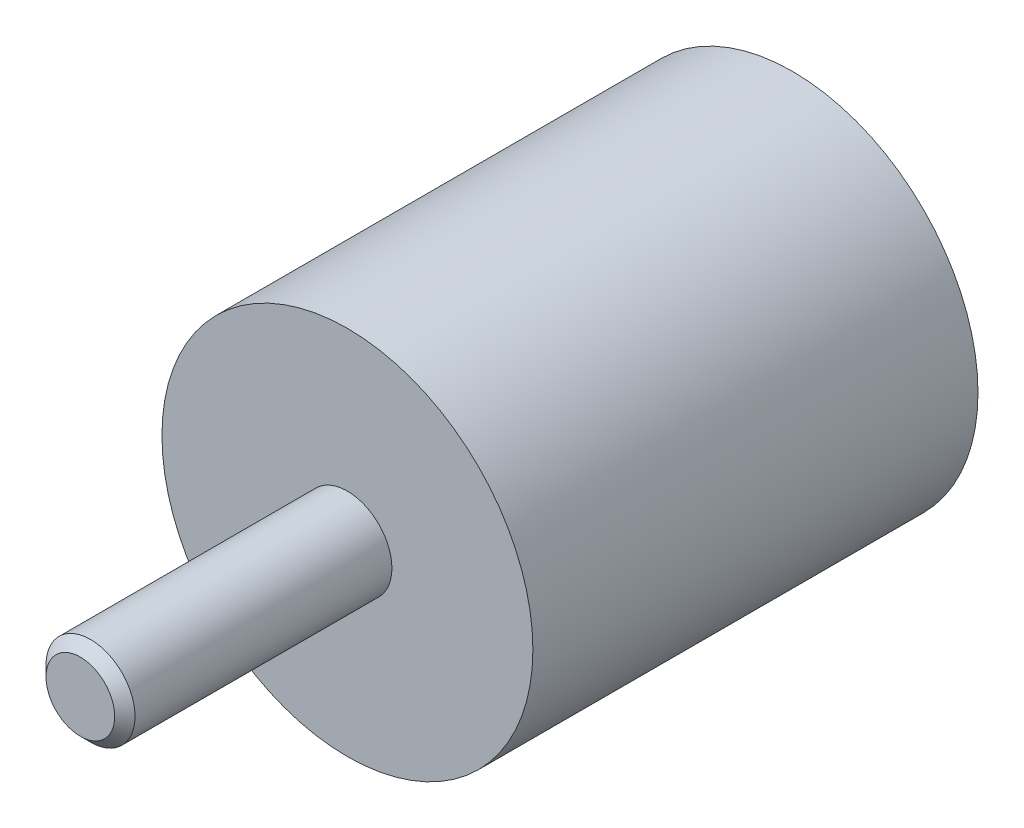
ISO-10303-21;
HEADER;
FILE_DESCRIPTION(('STEP AP214'),'2;1');
FILE_NAME('part.step','',(''),(''),'','','');
FILE_SCHEMA(('AUTOMOTIVE_DESIGN { 1 0 10303 214 1 1 1 1 }'));
ENDSEC;
DATA;
#1=APPLICATION_CONTEXT('core data for automotive mechanical design processes');
#2=APPLICATION_PROTOCOL_DEFINITION('international standard','automotive_design',2000,#1);
#3=PRODUCT_CONTEXT('',#1,'mechanical');
#4=PRODUCT('Part','Part','',(#3));
#5=PRODUCT_RELATED_PRODUCT_CATEGORY('part','',(#4));
#6=PRODUCT_DEFINITION_FORMATION('','',#4);
#7=PRODUCT_DEFINITION_CONTEXT('part definition',#1,'design');
#8=PRODUCT_DEFINITION('design','',#6,#7);
#9=PRODUCT_DEFINITION_SHAPE('','',#8);
#10=(LENGTH_UNIT() NAMED_UNIT(*) SI_UNIT(.MILLI.,.METRE.));
#11=(NAMED_UNIT(*) PLANE_ANGLE_UNIT() SI_UNIT($,.RADIAN.));
#12=(NAMED_UNIT(*) SI_UNIT($,.STERADIAN.) SOLID_ANGLE_UNIT());
#13=UNCERTAINTY_MEASURE_WITH_UNIT(LENGTH_MEASURE(1.E-05),#10,'distance_accuracy_value','');
#14=(GEOMETRIC_REPRESENTATION_CONTEXT(3) GLOBAL_UNCERTAINTY_ASSIGNED_CONTEXT((#13)) GLOBAL_UNIT_ASSIGNED_CONTEXT((#10,
#11,#12)) REPRESENTATION_CONTEXT('',''));
#15=CARTESIAN_POINT('',(0.,0.,0.));
#16=DIRECTION('',(0.,0.,1.));
#17=DIRECTION('',(1.,0.,0.));
#18=AXIS2_PLACEMENT_3D('',#15,#16,#17);
#19=CARTESIAN_POINT('',(0.,0.,0.5));
#20=DIRECTION('',(0.,0.,1.));
#21=DIRECTION('',(0.,-1.,0.));
#22=AXIS2_PLACEMENT_3D('',#19,#20,#21);
#23=CYLINDRICAL_SURFACE('',#22,12.5);
#24=CARTESIAN_POINT('',(0.,0.,0.));
#25=DIRECTION('',(0.,0.,1.));
#26=DIRECTION('',(0.,-1.,0.));
#27=AXIS2_PLACEMENT_3D('',#24,#25,#26);
#28=CIRCLE('',#27,12.5);
#29=CARTESIAN_POINT('',(0.,-12.5,0.));
#30=VERTEX_POINT('',#29);
#31=EDGE_CURVE('E27',#30,#30,#28,.T.);
#32=ORIENTED_EDGE('',*,*,#31,.T.);
#33=EDGE_LOOP('',(#32));
#34=FACE_BOUND('',#33,.T.);
#35=CARTESIAN_POINT('',(0.,0.,30.));
#36=DIRECTION('',(0.,0.,-1.));
#37=DIRECTION('',(-1.,0.,0.));
#38=AXIS2_PLACEMENT_3D('',#35,#36,#37);
#39=CIRCLE('',#38,12.5);
#40=CARTESIAN_POINT('',(-12.5,0.,30.));
#41=VERTEX_POINT('',#40);
#42=EDGE_CURVE('E35',#41,#41,#39,.T.);
#43=ORIENTED_EDGE('',*,*,#42,.T.);
#44=EDGE_LOOP('',(#43));
#45=FACE_BOUND('',#44,.T.);
#46=ADVANCED_FACE('F12',(#34,#45),#23,.T.);
#47=CARTESIAN_POINT('',(12.5,0.,0.));
#48=DIRECTION('',(0.,0.,-1.));
#49=DIRECTION('',(0.,1.,0.));
#50=AXIS2_PLACEMENT_3D('',#47,#48,#49);
#51=PLANE('',#50);
#52=CARTESIAN_POINT('',(0.,0.,0.));
#53=DIRECTION('',(0.,0.,-1.));
#54=DIRECTION('',(0.,1.,0.));
#55=AXIS2_PLACEMENT_3D('',#52,#53,#54);
#56=CIRCLE('',#55,3.45);
#57=CARTESIAN_POINT('',(0.,3.45,0.));
#58=VERTEX_POINT('',#57);
#59=EDGE_CURVE('E19',#58,#58,#56,.F.);
#60=ORIENTED_EDGE('',*,*,#59,.T.);
#61=EDGE_LOOP('',(#60));
#62=FACE_BOUND('',#61,.T.);
#63=ORIENTED_EDGE('',*,*,#31,.F.);
#64=EDGE_LOOP('',(#63));
#65=FACE_BOUND('',#64,.T.);
#66=ADVANCED_FACE('F58',(#62,#65),#51,.T.);
#67=CARTESIAN_POINT('',(0.,0.,0.));
#68=DIRECTION('',(0.,0.,1.));
#69=DIRECTION('',(0.,-1.,0.));
#70=AXIS2_PLACEMENT_3D('',#67,#68,#69);
#71=CYLINDRICAL_SURFACE('',#70,3.);
#72=CARTESIAN_POINT('',(0.,0.,0.45));
#73=DIRECTION('',(0.,0.,-1.));
#74=DIRECTION('',(0.,1.,0.));
#75=AXIS2_PLACEMENT_3D('',#72,#73,#74);
#76=CIRCLE('',#75,3.);
#77=CARTESIAN_POINT('',(0.,3.,0.45));
#78=VERTEX_POINT('',#77);
#79=EDGE_CURVE('E23',#78,#78,#76,.T.);
#80=ORIENTED_EDGE('',*,*,#79,.T.);
#81=EDGE_LOOP('',(#80));
#82=FACE_BOUND('',#81,.T.);
#83=CARTESIAN_POINT('',(0.,0.,6.));
#84=DIRECTION('',(0.,0.,-1.));
#85=DIRECTION('',(0.,1.,0.));
#86=AXIS2_PLACEMENT_3D('',#83,#84,#85);
#87=CIRCLE('',#86,3.);
#88=CARTESIAN_POINT('',(0.,3.,6.));
#89=VERTEX_POINT('',#88);
#90=EDGE_CURVE('E32',#89,#89,#87,.T.);
#91=ORIENTED_EDGE('',*,*,#90,.F.);
#92=EDGE_LOOP('',(#91));
#93=FACE_BOUND('',#92,.T.);
#94=ADVANCED_FACE('F63',(#82,#93),#71,.F.);
#95=CARTESIAN_POINT('',(0.,0.,6.));
#96=DIRECTION('',(0.,0.,-1.));
#97=DIRECTION('',(0.,1.,0.));
#98=AXIS2_PLACEMENT_3D('',#95,#96,#97);
#99=PLANE('',#98);
#100=ORIENTED_EDGE('',*,*,#90,.T.);
#101=EDGE_LOOP('',(#100));
#102=FACE_BOUND('',#101,.T.);
#103=ADVANCED_FACE('F69',(#102),#99,.T.);
#104=CARTESIAN_POINT('',(0.,0.,0.45));
#105=DIRECTION('',(0.,0.,-1.));
#106=DIRECTION('',(0.,1.,0.));
#107=AXIS2_PLACEMENT_3D('',#104,#105,#106);
#108=CONICAL_SURFACE('',#107,3.,0.785398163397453);
#109=ORIENTED_EDGE('',*,*,#59,.F.);
#110=EDGE_LOOP('',(#109));
#111=FACE_BOUND('',#110,.T.);
#112=ORIENTED_EDGE('',*,*,#79,.F.);
#113=EDGE_LOOP('',(#112));
#114=FACE_BOUND('',#113,.T.);
#115=ADVANCED_FACE('F14',(#111,#114),#108,.F.);
#116=CARTESIAN_POINT('',(0.,12.5,30.));
#117=DIRECTION('',(0.,0.,1.));
#118=DIRECTION('',(1.,0.,0.));
#119=AXIS2_PLACEMENT_3D('',#116,#117,#118);
#120=PLANE('',#119);
#121=CARTESIAN_POINT('',(0.,0.,30.));
#122=DIRECTION('',(0.,0.,1.));
#123=DIRECTION('',(1.,0.,0.));
#124=AXIS2_PLACEMENT_3D('',#121,#122,#123);
#125=CIRCLE('',#124,3.);
#126=CARTESIAN_POINT('',(3.,0.,30.));
#127=VERTEX_POINT('',#126);
#128=EDGE_CURVE('E8',#127,#127,#125,.F.);
#129=ORIENTED_EDGE('',*,*,#128,.T.);
#130=EDGE_LOOP('',(#129));
#131=FACE_BOUND('',#130,.T.);
#132=ORIENTED_EDGE('',*,*,#42,.F.);
#133=EDGE_LOOP('',(#132));
#134=FACE_BOUND('',#133,.T.);
#135=ADVANCED_FACE('F73',(#131,#134),#120,.T.);
#136=CARTESIAN_POINT('',(0.,0.,15.));
#137=DIRECTION('',(0.,0.,1.));
#138=DIRECTION('',(0.,-1.,0.));
#139=AXIS2_PLACEMENT_3D('',#136,#137,#138);
#140=CYLINDRICAL_SURFACE('',#139,3.);
#141=ORIENTED_EDGE('',*,*,#128,.F.);
#142=EDGE_LOOP('',(#141));
#143=FACE_BOUND('',#142,.T.);
#144=CARTESIAN_POINT('',(0.,0.,47.3144942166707));
#145=DIRECTION('',(0.,0.,-1.));
#146=DIRECTION('',(-1.,0.,0.));
#147=AXIS2_PLACEMENT_3D('',#144,#145,#146);
#148=CIRCLE('',#147,3.);
#149=CARTESIAN_POINT('',(-3.,0.,47.3144942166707));
#150=VERTEX_POINT('',#149);
#151=EDGE_CURVE('E38',#150,#150,#148,.T.);
#152=ORIENTED_EDGE('',*,*,#151,.T.);
#153=EDGE_LOOP('',(#152));
#154=FACE_BOUND('',#153,.T.);
#155=ADVANCED_FACE('F55',(#143,#154),#140,.T.);
#156=CARTESIAN_POINT('',(0.,0.,47.3144942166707));
#157=DIRECTION('',(0.,0.,-1.));
#158=DIRECTION('',(-1.,0.,0.));
#159=AXIS2_PLACEMENT_3D('',#156,#157,#158);
#160=CONICAL_SURFACE('',#159,3.,0.785398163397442);
#161=CARTESIAN_POINT('',(0.,0.,48.));
#162=DIRECTION('',(0.,0.,-1.));
#163=DIRECTION('',(-1.,0.,0.));
#164=AXIS2_PLACEMENT_3D('',#161,#162,#163);
#165=CIRCLE('',#164,2.3144942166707);
#166=CARTESIAN_POINT('',(-2.3144942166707,0.,48.));
#167=VERTEX_POINT('',#166);
#168=EDGE_CURVE('E41',#167,#167,#165,.T.);
#169=ORIENTED_EDGE('',*,*,#168,.T.);
#170=EDGE_LOOP('',(#169));
#171=FACE_BOUND('',#170,.T.);
#172=ORIENTED_EDGE('',*,*,#151,.F.);
#173=EDGE_LOOP('',(#172));
#174=FACE_BOUND('',#173,.T.);
#175=ADVANCED_FACE('F45',(#171,#174),#160,.T.);
#176=CARTESIAN_POINT('',(0.,2.3144942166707,48.));
#177=DIRECTION('',(0.,0.,1.));
#178=DIRECTION('',(1.,0.,0.));
#179=AXIS2_PLACEMENT_3D('',#176,#177,#178);
#180=PLANE('',#179);
#181=ORIENTED_EDGE('',*,*,#168,.F.);
#182=EDGE_LOOP('',(#181));
#183=FACE_BOUND('',#182,.T.);
#184=ADVANCED_FACE('F48',(#183),#180,.T.);
#185=CLOSED_SHELL('',(#46,#66,#94,#103,#115,#135,#155,#175,#184));
#186=MANIFOLD_SOLID_BREP('B1',#185);
#187=ADVANCED_BREP_SHAPE_REPRESENTATION('',(#18,#186),#14);
#188=SHAPE_DEFINITION_REPRESENTATION(#9,#187);
ENDSEC;
END-ISO-10303-21;
